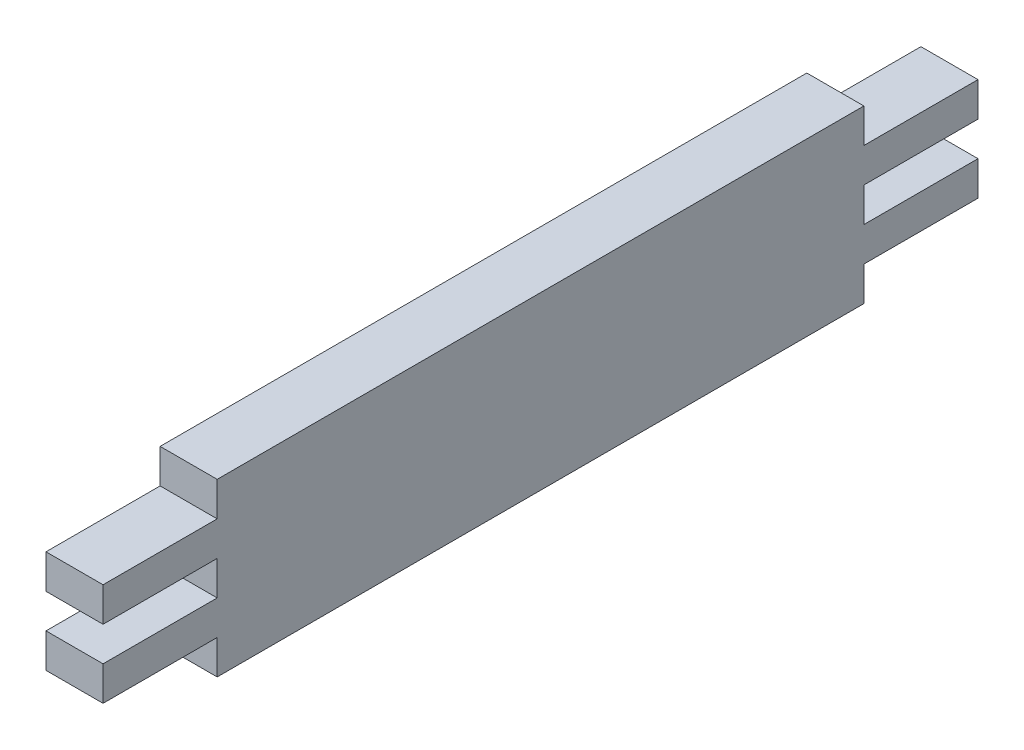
ISO-10303-21;
HEADER;
FILE_DESCRIPTION(('STEP AP214'),'2;1');
FILE_NAME('part.step','',(''),(''),'','','');
FILE_SCHEMA(('AUTOMOTIVE_DESIGN { 1 0 10303 214 1 1 1 1 }'));
ENDSEC;
DATA;
#1=APPLICATION_CONTEXT('core data for automotive mechanical design processes');
#2=APPLICATION_PROTOCOL_DEFINITION('international standard','automotive_design',2000,#1);
#3=PRODUCT_CONTEXT('',#1,'mechanical');
#4=PRODUCT('Part','Part','',(#3));
#5=PRODUCT_RELATED_PRODUCT_CATEGORY('part','',(#4));
#6=PRODUCT_DEFINITION_FORMATION('','',#4);
#7=PRODUCT_DEFINITION_CONTEXT('part definition',#1,'design');
#8=PRODUCT_DEFINITION('design','',#6,#7);
#9=PRODUCT_DEFINITION_SHAPE('','',#8);
#10=(LENGTH_UNIT() NAMED_UNIT(*) SI_UNIT(.MILLI.,.METRE.));
#11=(NAMED_UNIT(*) PLANE_ANGLE_UNIT() SI_UNIT($,.RADIAN.));
#12=(NAMED_UNIT(*) SI_UNIT($,.STERADIAN.) SOLID_ANGLE_UNIT());
#13=UNCERTAINTY_MEASURE_WITH_UNIT(LENGTH_MEASURE(1.E-05),#10,'distance_accuracy_value','');
#14=(GEOMETRIC_REPRESENTATION_CONTEXT(3) GLOBAL_UNCERTAINTY_ASSIGNED_CONTEXT((#13)) GLOBAL_UNIT_ASSIGNED_CONTEXT((#10,
#11,#12)) REPRESENTATION_CONTEXT('',''));
#15=CARTESIAN_POINT('',(0.,0.,0.));
#16=DIRECTION('',(0.,0.,1.));
#17=DIRECTION('',(1.,0.,0.));
#18=AXIS2_PLACEMENT_3D('',#15,#16,#17);
#19=CARTESIAN_POINT('',(3.,-4.5,23.));
#20=DIRECTION('',(0.,0.,-1.));
#21=DIRECTION('',(-1.,0.,0.));
#22=AXIS2_PLACEMENT_3D('',#19,#20,#21);
#23=PLANE('',#22);
#24=DIRECTION('',(0.,-1.,0.));
#25=VECTOR('',#24,1.);
#26=CARTESIAN_POINT('',(0.,-4.5,23.));
#27=LINE('',#26,#25);
#28=CARTESIAN_POINT('',(0.,2.7,23.));
#29=VERTEX_POINT('',#28);
#30=CARTESIAN_POINT('',(0.,0.9,23.));
#31=VERTEX_POINT('',#30);
#32=EDGE_CURVE('E193',#29,#31,#27,.T.);
#33=ORIENTED_EDGE('',*,*,#32,.T.);
#34=DIRECTION('',(-1.,0.,0.));
#35=VECTOR('',#34,1.);
#36=CARTESIAN_POINT('',(10.,0.9,23.));
#37=LINE('',#36,#35);
#38=CARTESIAN_POINT('',(3.,0.9,23.));
#39=VERTEX_POINT('',#38);
#40=EDGE_CURVE('E311',#39,#31,#37,.T.);
#41=ORIENTED_EDGE('',*,*,#40,.F.);
#42=DIRECTION('',(0.,-1.,0.));
#43=VECTOR('',#42,1.);
#44=CARTESIAN_POINT('',(3.,-4.5,23.));
#45=LINE('',#44,#43);
#46=CARTESIAN_POINT('',(3.,2.7,23.));
#47=VERTEX_POINT('',#46);
#48=EDGE_CURVE('E40',#47,#39,#45,.T.);
#49=ORIENTED_EDGE('',*,*,#48,.F.);
#50=DIRECTION('',(-1.,0.,0.));
#51=VECTOR('',#50,1.);
#52=CARTESIAN_POINT('',(10.,2.7,23.));
#53=LINE('',#52,#51);
#54=EDGE_CURVE('E288',#47,#29,#53,.T.);
#55=ORIENTED_EDGE('',*,*,#54,.T.);
#56=EDGE_LOOP('',(#33,#41,#49,#55));
#57=FACE_BOUND('',#56,.T.);
#58=ADVANCED_FACE('F31',(#57),#23,.F.);
#59=CARTESIAN_POINT('',(3.,-4.5,-23.));
#60=DIRECTION('',(0.,0.,1.));
#61=DIRECTION('',(1.,0.,0.));
#62=AXIS2_PLACEMENT_3D('',#59,#60,#61);
#63=PLANE('',#62);
#64=DIRECTION('',(0.,1.,0.));
#65=VECTOR('',#64,1.);
#66=CARTESIAN_POINT('',(3.,-4.5,-23.));
#67=LINE('',#66,#65);
#68=CARTESIAN_POINT('',(3.,0.9,-23.));
#69=VERTEX_POINT('',#68);
#70=CARTESIAN_POINT('',(3.,2.7,-23.));
#71=VERTEX_POINT('',#70);
#72=EDGE_CURVE('E192',#69,#71,#67,.T.);
#73=ORIENTED_EDGE('',*,*,#72,.F.);
#74=DIRECTION('',(-1.,0.,0.));
#75=VECTOR('',#74,1.);
#76=CARTESIAN_POINT('',(10.,0.9,-23.));
#77=LINE('',#76,#75);
#78=CARTESIAN_POINT('',(0.,0.9,-23.));
#79=VERTEX_POINT('',#78);
#80=EDGE_CURVE('E244',#69,#79,#77,.T.);
#81=ORIENTED_EDGE('',*,*,#80,.T.);
#82=DIRECTION('',(0.,1.,0.));
#83=VECTOR('',#82,1.);
#84=CARTESIAN_POINT('',(0.,-4.5,-23.));
#85=LINE('',#84,#83);
#86=CARTESIAN_POINT('',(0.,2.7,-23.));
#87=VERTEX_POINT('',#86);
#88=EDGE_CURVE('E208',#79,#87,#85,.T.);
#89=ORIENTED_EDGE('',*,*,#88,.T.);
#90=DIRECTION('',(-1.,0.,0.));
#91=VECTOR('',#90,1.);
#92=CARTESIAN_POINT('',(10.,2.7,-23.));
#93=LINE('',#92,#91);
#94=EDGE_CURVE('E223',#71,#87,#93,.T.);
#95=ORIENTED_EDGE('',*,*,#94,.F.);
#96=EDGE_LOOP('',(#73,#81,#89,#95));
#97=FACE_BOUND('',#96,.T.);
#98=ADVANCED_FACE('F369',(#97),#63,.F.);
#99=CARTESIAN_POINT('',(3.,-2.7,-23.));
#100=VERTEX_POINT('',#99);
#101=CARTESIAN_POINT('',(3.,-0.9,-23.));
#102=VERTEX_POINT('',#101);
#103=EDGE_CURVE('E194',#100,#102,#67,.T.);
#104=ORIENTED_EDGE('',*,*,#103,.F.);
#105=DIRECTION('',(-1.,0.,0.));
#106=VECTOR('',#105,1.);
#107=CARTESIAN_POINT('',(10.,-2.7,-23.));
#108=LINE('',#107,#106);
#109=CARTESIAN_POINT('',(0.,-2.7,-23.));
#110=VERTEX_POINT('',#109);
#111=EDGE_CURVE('E268',#100,#110,#108,.T.);
#112=ORIENTED_EDGE('',*,*,#111,.T.);
#113=CARTESIAN_POINT('',(0.,-0.900000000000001,-23.));
#114=VERTEX_POINT('',#113);
#115=EDGE_CURVE('E207',#110,#114,#85,.T.);
#116=ORIENTED_EDGE('',*,*,#115,.T.);
#117=DIRECTION('',(-1.,0.,0.));
#118=VECTOR('',#117,1.);
#119=CARTESIAN_POINT('',(10.,-0.9,-23.));
#120=LINE('',#119,#118);
#121=EDGE_CURVE('E245',#102,#114,#120,.T.);
#122=ORIENTED_EDGE('',*,*,#121,.F.);
#123=EDGE_LOOP('',(#104,#112,#116,#122));
#124=FACE_BOUND('',#123,.T.);
#125=ADVANCED_FACE('F33',(#124),#63,.F.);
#126=CARTESIAN_POINT('',(3.,4.5,23.));
#127=DIRECTION('',(0.,-1.,0.));
#128=DIRECTION('',(0.,0.,-1.));
#129=AXIS2_PLACEMENT_3D('',#126,#127,#128);
#130=PLANE('',#129);
#131=DIRECTION('',(0.,0.,1.));
#132=VECTOR('',#131,1.);
#133=CARTESIAN_POINT('',(0.,4.5,23.));
#134=LINE('',#133,#132);
#135=CARTESIAN_POINT('',(0.,4.5,-17.));
#136=VERTEX_POINT('',#135);
#137=CARTESIAN_POINT('',(0.,4.5,17.));
#138=VERTEX_POINT('',#137);
#139=EDGE_CURVE('E203',#136,#138,#134,.T.);
#140=ORIENTED_EDGE('',*,*,#139,.T.);
#141=DIRECTION('',(-1.,0.,0.));
#142=VECTOR('',#141,1.);
#143=CARTESIAN_POINT('',(10.,4.5,17.));
#144=LINE('',#143,#142);
#145=CARTESIAN_POINT('',(3.,4.5,17.));
#146=VERTEX_POINT('',#145);
#147=EDGE_CURVE('E284',#146,#138,#144,.T.);
#148=ORIENTED_EDGE('',*,*,#147,.F.);
#149=DIRECTION('',(0.,0.,1.));
#150=VECTOR('',#149,1.);
#151=CARTESIAN_POINT('',(3.,4.5,23.));
#152=LINE('',#151,#150);
#153=CARTESIAN_POINT('',(3.,4.5,-17.));
#154=VERTEX_POINT('',#153);
#155=EDGE_CURVE('E213',#154,#146,#152,.T.);
#156=ORIENTED_EDGE('',*,*,#155,.F.);
#157=DIRECTION('',(-1.,0.,0.));
#158=VECTOR('',#157,1.);
#159=CARTESIAN_POINT('',(10.,4.5,-17.));
#160=LINE('',#159,#158);
#161=EDGE_CURVE('E222',#154,#136,#160,.T.);
#162=ORIENTED_EDGE('',*,*,#161,.T.);
#163=EDGE_LOOP('',(#140,#148,#156,#162));
#164=FACE_BOUND('',#163,.T.);
#165=ADVANCED_FACE('F354',(#164),#130,.F.);
#166=CARTESIAN_POINT('',(0.,-0.9,23.));
#167=VERTEX_POINT('',#166);
#168=CARTESIAN_POINT('',(0.,-2.7,23.));
#169=VERTEX_POINT('',#168);
#170=EDGE_CURVE('E197',#167,#169,#27,.T.);
#171=ORIENTED_EDGE('',*,*,#170,.T.);
#172=DIRECTION('',(-1.,0.,0.));
#173=VECTOR('',#172,1.);
#174=CARTESIAN_POINT('',(10.,-2.7,23.));
#175=LINE('',#174,#173);
#176=CARTESIAN_POINT('',(3.,-2.7,23.));
#177=VERTEX_POINT('',#176);
#178=EDGE_CURVE('E48',#177,#169,#175,.T.);
#179=ORIENTED_EDGE('',*,*,#178,.F.);
#180=CARTESIAN_POINT('',(3.,-0.9,23.));
#181=VERTEX_POINT('',#180);
#182=EDGE_CURVE('E212',#181,#177,#45,.T.);
#183=ORIENTED_EDGE('',*,*,#182,.F.);
#184=DIRECTION('',(-1.,0.,0.));
#185=VECTOR('',#184,1.);
#186=CARTESIAN_POINT('',(10.,-0.9,23.));
#187=LINE('',#186,#185);
#188=EDGE_CURVE('E307',#181,#167,#187,.T.);
#189=ORIENTED_EDGE('',*,*,#188,.T.);
#190=EDGE_LOOP('',(#171,#179,#183,#189));
#191=FACE_BOUND('',#190,.T.);
#192=ADVANCED_FACE('F330',(#191),#23,.F.);
#193=CARTESIAN_POINT('',(3.,-4.5,23.));
#194=DIRECTION('',(0.,1.,0.));
#195=DIRECTION('',(0.,0.,1.));
#196=AXIS2_PLACEMENT_3D('',#193,#194,#195);
#197=PLANE('',#196);
#198=DIRECTION('',(0.,0.,-1.));
#199=VECTOR('',#198,1.);
#200=CARTESIAN_POINT('',(3.,-4.5,23.));
#201=LINE('',#200,#199);
#202=CARTESIAN_POINT('',(3.,-4.5,17.));
#203=VERTEX_POINT('',#202);
#204=CARTESIAN_POINT('',(3.,-4.5,-17.));
#205=VERTEX_POINT('',#204);
#206=EDGE_CURVE('E11',#203,#205,#201,.T.);
#207=ORIENTED_EDGE('',*,*,#206,.F.);
#208=DIRECTION('',(-1.,0.,0.));
#209=VECTOR('',#208,1.);
#210=CARTESIAN_POINT('',(10.,-4.5,17.));
#211=LINE('',#210,#209);
#212=CARTESIAN_POINT('',(0.,-4.5,17.));
#213=VERTEX_POINT('',#212);
#214=EDGE_CURVE('E173',#203,#213,#211,.T.);
#215=ORIENTED_EDGE('',*,*,#214,.T.);
#216=DIRECTION('',(0.,0.,-1.));
#217=VECTOR('',#216,1.);
#218=CARTESIAN_POINT('',(0.,-4.5,23.));
#219=LINE('',#218,#217);
#220=CARTESIAN_POINT('',(0.,-4.5,-17.));
#221=VERTEX_POINT('',#220);
#222=EDGE_CURVE('E35',#213,#221,#219,.T.);
#223=ORIENTED_EDGE('',*,*,#222,.T.);
#224=DIRECTION('',(-1.,0.,0.));
#225=VECTOR('',#224,1.);
#226=CARTESIAN_POINT('',(10.,-4.5,-17.));
#227=LINE('',#226,#225);
#228=EDGE_CURVE('E269',#205,#221,#227,.T.);
#229=ORIENTED_EDGE('',*,*,#228,.F.);
#230=EDGE_LOOP('',(#207,#215,#223,#229));
#231=FACE_BOUND('',#230,.T.);
#232=ADVANCED_FACE('F183',(#231),#197,.F.);
#233=CARTESIAN_POINT('',(3.,4.5,-23.));
#234=DIRECTION('',(-1.,0.,0.));
#235=DIRECTION('',(0.,0.,1.));
#236=AXIS2_PLACEMENT_3D('',#233,#234,#235);
#237=PLANE('',#236);
#238=DIRECTION('',(0.,0.,-1.));
#239=VECTOR('',#238,1.);
#240=CARTESIAN_POINT('',(3.,-2.7,-23.));
#241=LINE('',#240,#239);
#242=CARTESIAN_POINT('',(3.,-2.7,17.));
#243=VERTEX_POINT('',#242);
#244=EDGE_CURVE('E321',#177,#243,#241,.T.);
#245=ORIENTED_EDGE('',*,*,#244,.T.);
#246=DIRECTION('',(0.,-1.,0.));
#247=VECTOR('',#246,1.);
#248=CARTESIAN_POINT('',(3.,4.5,17.));
#249=LINE('',#248,#247);
#250=EDGE_CURVE('E319',#243,#203,#249,.T.);
#251=ORIENTED_EDGE('',*,*,#250,.T.);
#252=ORIENTED_EDGE('',*,*,#206,.T.);
#253=DIRECTION('',(0.,1.,0.));
#254=VECTOR('',#253,1.);
#255=CARTESIAN_POINT('',(3.,4.5,-17.));
#256=LINE('',#255,#254);
#257=CARTESIAN_POINT('',(3.,-2.7,-17.));
#258=VERTEX_POINT('',#257);
#259=EDGE_CURVE('E265',#205,#258,#256,.T.);
#260=ORIENTED_EDGE('',*,*,#259,.T.);
#261=DIRECTION('',(0.,0.,-1.));
#262=VECTOR('',#261,1.);
#263=CARTESIAN_POINT('',(3.,-2.7,-23.));
#264=LINE('',#263,#262);
#265=EDGE_CURVE('E262',#258,#100,#264,.T.);
#266=ORIENTED_EDGE('',*,*,#265,.T.);
#267=ORIENTED_EDGE('',*,*,#103,.T.);
#268=DIRECTION('',(0.,0.,1.));
#269=VECTOR('',#268,1.);
#270=CARTESIAN_POINT('',(3.,-0.900000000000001,-23.));
#271=LINE('',#270,#269);
#272=CARTESIAN_POINT('',(3.,-0.9,-17.));
#273=VERTEX_POINT('',#272);
#274=EDGE_CURVE('E241',#102,#273,#271,.T.);
#275=ORIENTED_EDGE('',*,*,#274,.T.);
#276=DIRECTION('',(0.,1.,0.));
#277=VECTOR('',#276,1.);
#278=CARTESIAN_POINT('',(3.,4.5,-17.));
#279=LINE('',#278,#277);
#280=CARTESIAN_POINT('',(3.,0.9,-17.));
#281=VERTEX_POINT('',#280);
#282=EDGE_CURVE('E238',#273,#281,#279,.T.);
#283=ORIENTED_EDGE('',*,*,#282,.T.);
#284=DIRECTION('',(0.,0.,-1.));
#285=VECTOR('',#284,1.);
#286=CARTESIAN_POINT('',(3.,0.9,-23.));
#287=LINE('',#286,#285);
#288=EDGE_CURVE('E235',#281,#69,#287,.T.);
#289=ORIENTED_EDGE('',*,*,#288,.T.);
#290=ORIENTED_EDGE('',*,*,#72,.T.);
#291=DIRECTION('',(0.,0.,1.));
#292=VECTOR('',#291,1.);
#293=CARTESIAN_POINT('',(3.,2.7,-23.));
#294=LINE('',#293,#292);
#295=CARTESIAN_POINT('',(3.,2.7,-17.));
#296=VERTEX_POINT('',#295);
#297=EDGE_CURVE('E219',#71,#296,#294,.T.);
#298=ORIENTED_EDGE('',*,*,#297,.T.);
#299=DIRECTION('',(0.,1.,0.));
#300=VECTOR('',#299,1.);
#301=CARTESIAN_POINT('',(3.,4.5,-17.));
#302=LINE('',#301,#300);
#303=EDGE_CURVE('E216',#296,#154,#302,.T.);
#304=ORIENTED_EDGE('',*,*,#303,.T.);
#305=ORIENTED_EDGE('',*,*,#155,.T.);
#306=DIRECTION('',(0.,-1.,0.));
#307=VECTOR('',#306,1.);
#308=CARTESIAN_POINT('',(3.,4.5,17.));
#309=LINE('',#308,#307);
#310=CARTESIAN_POINT('',(3.,2.7,17.));
#311=VERTEX_POINT('',#310);
#312=EDGE_CURVE('E278',#146,#311,#309,.T.);
#313=ORIENTED_EDGE('',*,*,#312,.T.);
#314=DIRECTION('',(0.,0.,1.));
#315=VECTOR('',#314,1.);
#316=CARTESIAN_POINT('',(3.,2.7,-23.));
#317=LINE('',#316,#315);
#318=EDGE_CURVE('E281',#311,#47,#317,.T.);
#319=ORIENTED_EDGE('',*,*,#318,.T.);
#320=ORIENTED_EDGE('',*,*,#48,.T.);
#321=DIRECTION('',(0.,0.,-1.));
#322=VECTOR('',#321,1.);
#323=CARTESIAN_POINT('',(3.,0.9,-23.));
#324=LINE('',#323,#322);
#325=CARTESIAN_POINT('',(3.,0.9,17.));
#326=VERTEX_POINT('',#325);
#327=EDGE_CURVE('E298',#39,#326,#324,.T.);
#328=ORIENTED_EDGE('',*,*,#327,.T.);
#329=DIRECTION('',(0.,-1.,0.));
#330=VECTOR('',#329,1.);
#331=CARTESIAN_POINT('',(3.,4.5,17.));
#332=LINE('',#331,#330);
#333=CARTESIAN_POINT('',(3.,-0.9,17.));
#334=VERTEX_POINT('',#333);
#335=EDGE_CURVE('E295',#326,#334,#332,.T.);
#336=ORIENTED_EDGE('',*,*,#335,.T.);
#337=DIRECTION('',(0.,0.,1.));
#338=VECTOR('',#337,1.);
#339=CARTESIAN_POINT('',(3.,-0.900000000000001,-23.));
#340=LINE('',#339,#338);
#341=EDGE_CURVE('E301',#334,#181,#340,.T.);
#342=ORIENTED_EDGE('',*,*,#341,.T.);
#343=ORIENTED_EDGE('',*,*,#182,.T.);
#344=EDGE_LOOP('',(#245,#251,#252,#260,#266,#267,#275,#283,#289,#290,#298,#304,#305,#313,#319,
#320,#328,#336,#342,#343));
#345=FACE_BOUND('',#344,.T.);
#346=ADVANCED_FACE('F336',(#345),#237,.F.);
#347=CARTESIAN_POINT('',(0.,4.5,-23.));
#348=DIRECTION('',(-1.,0.,0.));
#349=DIRECTION('',(0.,0.,1.));
#350=AXIS2_PLACEMENT_3D('',#347,#348,#349);
#351=PLANE('',#350);
#352=DIRECTION('',(0.,-1.,0.));
#353=VECTOR('',#352,1.);
#354=CARTESIAN_POINT('',(0.,-2.7,17.));
#355=LINE('',#354,#353);
#356=CARTESIAN_POINT('',(0.,-2.7,17.));
#357=VERTEX_POINT('',#356);
#358=EDGE_CURVE('E170',#357,#213,#355,.T.);
#359=ORIENTED_EDGE('',*,*,#358,.F.);
#360=DIRECTION('',(0.,0.,-1.));
#361=VECTOR('',#360,1.);
#362=CARTESIAN_POINT('',(0.,-2.7,17.));
#363=LINE('',#362,#361);
#364=EDGE_CURVE('E179',#169,#357,#363,.T.);
#365=ORIENTED_EDGE('',*,*,#364,.F.);
#366=ORIENTED_EDGE('',*,*,#170,.F.);
#367=DIRECTION('',(0.,0.,1.));
#368=VECTOR('',#367,1.);
#369=CARTESIAN_POINT('',(0.,-0.9,17.));
#370=LINE('',#369,#368);
#371=CARTESIAN_POINT('',(0.,-0.900000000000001,17.));
#372=VERTEX_POINT('',#371);
#373=EDGE_CURVE('E316',#372,#167,#370,.T.);
#374=ORIENTED_EDGE('',*,*,#373,.F.);
#375=DIRECTION('',(0.,-1.,0.));
#376=VECTOR('',#375,1.);
#377=CARTESIAN_POINT('',(0.,0.9,17.));
#378=LINE('',#377,#376);
#379=CARTESIAN_POINT('',(0.,0.9,17.));
#380=VERTEX_POINT('',#379);
#381=EDGE_CURVE('E56',#380,#372,#378,.T.);
#382=ORIENTED_EDGE('',*,*,#381,.F.);
#383=DIRECTION('',(0.,0.,-1.));
#384=VECTOR('',#383,1.);
#385=CARTESIAN_POINT('',(0.,0.9,17.));
#386=LINE('',#385,#384);
#387=EDGE_CURVE('E308',#31,#380,#386,.T.);
#388=ORIENTED_EDGE('',*,*,#387,.F.);
#389=ORIENTED_EDGE('',*,*,#32,.F.);
#390=DIRECTION('',(0.,0.,1.));
#391=VECTOR('',#390,1.);
#392=CARTESIAN_POINT('',(0.,2.7,17.));
#393=LINE('',#392,#391);
#394=CARTESIAN_POINT('',(0.,2.7,17.));
#395=VERTEX_POINT('',#394);
#396=EDGE_CURVE('E289',#395,#29,#393,.T.);
#397=ORIENTED_EDGE('',*,*,#396,.F.);
#398=DIRECTION('',(0.,-1.,0.));
#399=VECTOR('',#398,1.);
#400=CARTESIAN_POINT('',(0.,4.5,17.));
#401=LINE('',#400,#399);
#402=EDGE_CURVE('E293',#138,#395,#401,.T.);
#403=ORIENTED_EDGE('',*,*,#402,.F.);
#404=ORIENTED_EDGE('',*,*,#139,.F.);
#405=DIRECTION('',(0.,1.,0.));
#406=VECTOR('',#405,1.);
#407=CARTESIAN_POINT('',(0.,4.5,-17.));
#408=LINE('',#407,#406);
#409=CARTESIAN_POINT('',(0.,2.7,-17.));
#410=VERTEX_POINT('',#409);
#411=EDGE_CURVE('E227',#410,#136,#408,.T.);
#412=ORIENTED_EDGE('',*,*,#411,.F.);
#413=DIRECTION('',(0.,0.,1.));
#414=VECTOR('',#413,1.);
#415=CARTESIAN_POINT('',(0.,2.7,-23.));
#416=LINE('',#415,#414);
#417=EDGE_CURVE('E232',#87,#410,#416,.T.);
#418=ORIENTED_EDGE('',*,*,#417,.F.);
#419=ORIENTED_EDGE('',*,*,#88,.F.);
#420=DIRECTION('',(0.,0.,-1.));
#421=VECTOR('',#420,1.);
#422=CARTESIAN_POINT('',(0.,0.9,-23.));
#423=LINE('',#422,#421);
#424=CARTESIAN_POINT('',(0.,0.9,-17.));
#425=VERTEX_POINT('',#424);
#426=EDGE_CURVE('E249',#425,#79,#423,.T.);
#427=ORIENTED_EDGE('',*,*,#426,.F.);
#428=DIRECTION('',(0.,1.,0.));
#429=VECTOR('',#428,1.);
#430=CARTESIAN_POINT('',(0.,0.9,-17.));
#431=LINE('',#430,#429);
#432=CARTESIAN_POINT('',(0.,-0.9,-17.));
#433=VERTEX_POINT('',#432);
#434=EDGE_CURVE('E256',#433,#425,#431,.T.);
#435=ORIENTED_EDGE('',*,*,#434,.F.);
#436=DIRECTION('',(0.,0.,1.));
#437=VECTOR('',#436,1.);
#438=CARTESIAN_POINT('',(0.,-0.9,-23.));
#439=LINE('',#438,#437);
#440=EDGE_CURVE('E259',#114,#433,#439,.T.);
#441=ORIENTED_EDGE('',*,*,#440,.F.);
#442=ORIENTED_EDGE('',*,*,#115,.F.);
#443=DIRECTION('',(0.,0.,-1.));
#444=VECTOR('',#443,1.);
#445=CARTESIAN_POINT('',(0.,-2.7,-23.));
#446=LINE('',#445,#444);
#447=CARTESIAN_POINT('',(0.,-2.7,-17.));
#448=VERTEX_POINT('',#447);
#449=EDGE_CURVE('E272',#448,#110,#446,.T.);
#450=ORIENTED_EDGE('',*,*,#449,.F.);
#451=DIRECTION('',(0.,1.,0.));
#452=VECTOR('',#451,1.);
#453=CARTESIAN_POINT('',(0.,-2.7,-17.));
#454=LINE('',#453,#452);
#455=EDGE_CURVE('E191',#221,#448,#454,.T.);
#456=ORIENTED_EDGE('',*,*,#455,.F.);
#457=ORIENTED_EDGE('',*,*,#222,.F.);
#458=EDGE_LOOP('',(#359,#365,#366,#374,#382,#388,#389,#397,#403,#404,#412,#418,#419,#427,#435,
#441,#442,#450,#456,#457));
#459=FACE_BOUND('',#458,.T.);
#460=ADVANCED_FACE('F188',(#459),#351,.T.);
#461=CARTESIAN_POINT('',(10.,4.5,-17.));
#462=DIRECTION('',(0.,0.,1.));
#463=DIRECTION('',(1.,0.,0.));
#464=AXIS2_PLACEMENT_3D('',#461,#462,#463);
#465=PLANE('',#464);
#466=DIRECTION('',(-1.,0.,0.));
#467=VECTOR('',#466,1.);
#468=CARTESIAN_POINT('',(10.,2.7,-17.));
#469=LINE('',#468,#467);
#470=EDGE_CURVE('E226',#296,#410,#469,.T.);
#471=ORIENTED_EDGE('',*,*,#470,.T.);
#472=ORIENTED_EDGE('',*,*,#411,.T.);
#473=ORIENTED_EDGE('',*,*,#161,.F.);
#474=ORIENTED_EDGE('',*,*,#303,.F.);
#475=EDGE_LOOP('',(#471,#472,#473,#474));
#476=FACE_BOUND('',#475,.T.);
#477=ADVANCED_FACE('F358',(#476),#465,.F.);
#478=CARTESIAN_POINT('',(10.,2.7,-23.));
#479=DIRECTION('',(0.,-1.,0.));
#480=DIRECTION('',(0.,0.,-1.));
#481=AXIS2_PLACEMENT_3D('',#478,#479,#480);
#482=PLANE('',#481);
#483=ORIENTED_EDGE('',*,*,#94,.T.);
#484=ORIENTED_EDGE('',*,*,#417,.T.);
#485=ORIENTED_EDGE('',*,*,#470,.F.);
#486=ORIENTED_EDGE('',*,*,#297,.F.);
#487=EDGE_LOOP('',(#483,#484,#485,#486));
#488=FACE_BOUND('',#487,.T.);
#489=ADVANCED_FACE('F360',(#488),#482,.F.);
#490=CARTESIAN_POINT('',(10.,0.9,-23.));
#491=DIRECTION('',(0.,1.,0.));
#492=DIRECTION('',(0.,0.,1.));
#493=AXIS2_PLACEMENT_3D('',#490,#491,#492);
#494=PLANE('',#493);
#495=DIRECTION('',(-1.,0.,0.));
#496=VECTOR('',#495,1.);
#497=CARTESIAN_POINT('',(10.,0.9,-17.));
#498=LINE('',#497,#496);
#499=EDGE_CURVE('E251',#281,#425,#498,.T.);
#500=ORIENTED_EDGE('',*,*,#499,.T.);
#501=ORIENTED_EDGE('',*,*,#426,.T.);
#502=ORIENTED_EDGE('',*,*,#80,.F.);
#503=ORIENTED_EDGE('',*,*,#288,.F.);
#504=EDGE_LOOP('',(#500,#501,#502,#503));
#505=FACE_BOUND('',#504,.T.);
#506=ADVANCED_FACE('F371',(#505),#494,.F.);
#507=CARTESIAN_POINT('',(10.,0.9,-17.));
#508=DIRECTION('',(0.,0.,1.));
#509=DIRECTION('',(1.,0.,0.));
#510=AXIS2_PLACEMENT_3D('',#507,#508,#509);
#511=PLANE('',#510);
#512=DIRECTION('',(-1.,0.,0.));
#513=VECTOR('',#512,1.);
#514=CARTESIAN_POINT('',(10.,-0.9,-17.));
#515=LINE('',#514,#513);
#516=EDGE_CURVE('E248',#273,#433,#515,.T.);
#517=ORIENTED_EDGE('',*,*,#516,.T.);
#518=ORIENTED_EDGE('',*,*,#434,.T.);
#519=ORIENTED_EDGE('',*,*,#499,.F.);
#520=ORIENTED_EDGE('',*,*,#282,.F.);
#521=EDGE_LOOP('',(#517,#518,#519,#520));
#522=FACE_BOUND('',#521,.T.);
#523=ADVANCED_FACE('F376',(#522),#511,.F.);
#524=CARTESIAN_POINT('',(10.,-0.9,-23.));
#525=DIRECTION('',(0.,-1.,0.));
#526=DIRECTION('',(0.,0.,-1.));
#527=AXIS2_PLACEMENT_3D('',#524,#525,#526);
#528=PLANE('',#527);
#529=ORIENTED_EDGE('',*,*,#121,.T.);
#530=ORIENTED_EDGE('',*,*,#440,.T.);
#531=ORIENTED_EDGE('',*,*,#516,.F.);
#532=ORIENTED_EDGE('',*,*,#274,.F.);
#533=EDGE_LOOP('',(#529,#530,#531,#532));
#534=FACE_BOUND('',#533,.T.);
#535=ADVANCED_FACE('F378',(#534),#528,.F.);
#536=CARTESIAN_POINT('',(10.,-2.7,-23.));
#537=DIRECTION('',(0.,1.,0.));
#538=DIRECTION('',(0.,0.,1.));
#539=AXIS2_PLACEMENT_3D('',#536,#537,#538);
#540=PLANE('',#539);
#541=DIRECTION('',(-1.,0.,0.));
#542=VECTOR('',#541,1.);
#543=CARTESIAN_POINT('',(10.,-2.7,-17.));
#544=LINE('',#543,#542);
#545=EDGE_CURVE('E271',#258,#448,#544,.T.);
#546=ORIENTED_EDGE('',*,*,#545,.T.);
#547=ORIENTED_EDGE('',*,*,#449,.T.);
#548=ORIENTED_EDGE('',*,*,#111,.F.);
#549=ORIENTED_EDGE('',*,*,#265,.F.);
#550=EDGE_LOOP('',(#546,#547,#548,#549));
#551=FACE_BOUND('',#550,.T.);
#552=ADVANCED_FACE('F385',(#551),#540,.F.);
#553=CARTESIAN_POINT('',(10.,-2.7,-17.));
#554=DIRECTION('',(0.,0.,1.));
#555=DIRECTION('',(1.,0.,0.));
#556=AXIS2_PLACEMENT_3D('',#553,#554,#555);
#557=PLANE('',#556);
#558=ORIENTED_EDGE('',*,*,#228,.T.);
#559=ORIENTED_EDGE('',*,*,#455,.T.);
#560=ORIENTED_EDGE('',*,*,#545,.F.);
#561=ORIENTED_EDGE('',*,*,#259,.F.);
#562=EDGE_LOOP('',(#558,#559,#560,#561));
#563=FACE_BOUND('',#562,.T.);
#564=ADVANCED_FACE('F389',(#563),#557,.F.);
#565=CARTESIAN_POINT('',(10.,4.5,17.));
#566=DIRECTION('',(0.,0.,-1.));
#567=DIRECTION('',(-1.,0.,0.));
#568=AXIS2_PLACEMENT_3D('',#565,#566,#567);
#569=PLANE('',#568);
#570=ORIENTED_EDGE('',*,*,#147,.T.);
#571=ORIENTED_EDGE('',*,*,#402,.T.);
#572=DIRECTION('',(-1.,0.,0.));
#573=VECTOR('',#572,1.);
#574=CARTESIAN_POINT('',(10.,2.7,17.));
#575=LINE('',#574,#573);
#576=EDGE_CURVE('E285',#311,#395,#575,.T.);
#577=ORIENTED_EDGE('',*,*,#576,.F.);
#578=ORIENTED_EDGE('',*,*,#312,.F.);
#579=EDGE_LOOP('',(#570,#571,#577,#578));
#580=FACE_BOUND('',#579,.T.);
#581=ADVANCED_FACE('F350',(#580),#569,.F.);
#582=CARTESIAN_POINT('',(10.,2.7,17.));
#583=DIRECTION('',(0.,-1.,0.));
#584=DIRECTION('',(0.,0.,-1.));
#585=AXIS2_PLACEMENT_3D('',#582,#583,#584);
#586=PLANE('',#585);
#587=ORIENTED_EDGE('',*,*,#576,.T.);
#588=ORIENTED_EDGE('',*,*,#396,.T.);
#589=ORIENTED_EDGE('',*,*,#54,.F.);
#590=ORIENTED_EDGE('',*,*,#318,.F.);
#591=EDGE_LOOP('',(#587,#588,#589,#590));
#592=FACE_BOUND('',#591,.T.);
#593=ADVANCED_FACE('F346',(#592),#586,.F.);
#594=CARTESIAN_POINT('',(10.,0.9,17.));
#595=DIRECTION('',(0.,0.,-1.));
#596=DIRECTION('',(-1.,0.,0.));
#597=AXIS2_PLACEMENT_3D('',#594,#595,#596);
#598=PLANE('',#597);
#599=DIRECTION('',(-1.,0.,0.));
#600=VECTOR('',#599,1.);
#601=CARTESIAN_POINT('',(10.,0.9,17.));
#602=LINE('',#601,#600);
#603=EDGE_CURVE('E304',#326,#380,#602,.T.);
#604=ORIENTED_EDGE('',*,*,#603,.T.);
#605=ORIENTED_EDGE('',*,*,#381,.T.);
#606=DIRECTION('',(-1.,0.,0.));
#607=VECTOR('',#606,1.);
#608=CARTESIAN_POINT('',(10.,-0.9,17.));
#609=LINE('',#608,#607);
#610=EDGE_CURVE('E305',#334,#372,#609,.T.);
#611=ORIENTED_EDGE('',*,*,#610,.F.);
#612=ORIENTED_EDGE('',*,*,#335,.F.);
#613=EDGE_LOOP('',(#604,#605,#611,#612));
#614=FACE_BOUND('',#613,.T.);
#615=ADVANCED_FACE('F338',(#614),#598,.F.);
#616=CARTESIAN_POINT('',(10.,0.9,17.));
#617=DIRECTION('',(0.,1.,0.));
#618=DIRECTION('',(0.,0.,1.));
#619=AXIS2_PLACEMENT_3D('',#616,#617,#618);
#620=PLANE('',#619);
#621=ORIENTED_EDGE('',*,*,#40,.T.);
#622=ORIENTED_EDGE('',*,*,#387,.T.);
#623=ORIENTED_EDGE('',*,*,#603,.F.);
#624=ORIENTED_EDGE('',*,*,#327,.F.);
#625=EDGE_LOOP('',(#621,#622,#623,#624));
#626=FACE_BOUND('',#625,.T.);
#627=ADVANCED_FACE('F340',(#626),#620,.F.);
#628=CARTESIAN_POINT('',(10.,-0.9,17.));
#629=DIRECTION('',(0.,-1.,0.));
#630=DIRECTION('',(0.,0.,-1.));
#631=AXIS2_PLACEMENT_3D('',#628,#629,#630);
#632=PLANE('',#631);
#633=ORIENTED_EDGE('',*,*,#610,.T.);
#634=ORIENTED_EDGE('',*,*,#373,.T.);
#635=ORIENTED_EDGE('',*,*,#188,.F.);
#636=ORIENTED_EDGE('',*,*,#341,.F.);
#637=EDGE_LOOP('',(#633,#634,#635,#636));
#638=FACE_BOUND('',#637,.T.);
#639=ADVANCED_FACE('F334',(#638),#632,.F.);
#640=CARTESIAN_POINT('',(10.,-2.7,17.));
#641=DIRECTION('',(0.,0.,-1.));
#642=DIRECTION('',(-1.,0.,0.));
#643=AXIS2_PLACEMENT_3D('',#640,#641,#642);
#644=PLANE('',#643);
#645=DIRECTION('',(-1.,0.,0.));
#646=VECTOR('',#645,1.);
#647=CARTESIAN_POINT('',(10.,-2.7,17.));
#648=LINE('',#647,#646);
#649=EDGE_CURVE('E176',#243,#357,#648,.T.);
#650=ORIENTED_EDGE('',*,*,#649,.T.);
#651=ORIENTED_EDGE('',*,*,#358,.T.);
#652=ORIENTED_EDGE('',*,*,#214,.F.);
#653=ORIENTED_EDGE('',*,*,#250,.F.);
#654=EDGE_LOOP('',(#650,#651,#652,#653));
#655=FACE_BOUND('',#654,.T.);
#656=ADVANCED_FACE('F172',(#655),#644,.F.);
#657=CARTESIAN_POINT('',(10.,-2.7,17.));
#658=DIRECTION('',(0.,1.,0.));
#659=DIRECTION('',(0.,0.,1.));
#660=AXIS2_PLACEMENT_3D('',#657,#658,#659);
#661=PLANE('',#660);
#662=ORIENTED_EDGE('',*,*,#178,.T.);
#663=ORIENTED_EDGE('',*,*,#364,.T.);
#664=ORIENTED_EDGE('',*,*,#649,.F.);
#665=ORIENTED_EDGE('',*,*,#244,.F.);
#666=EDGE_LOOP('',(#662,#663,#664,#665));
#667=FACE_BOUND('',#666,.T.);
#668=ADVANCED_FACE('F326',(#667),#661,.F.);
#669=CLOSED_SHELL('',(#58,#98,#125,#165,#192,#232,#346,#460,#477,#489,#506,#523,#535,#552,#564,
#581,#593,#615,#627,#639,#656,#668));
#670=MANIFOLD_SOLID_BREP('B2',#669);
#671=ADVANCED_BREP_SHAPE_REPRESENTATION('',(#18,#670),#14);
#672=SHAPE_DEFINITION_REPRESENTATION(#9,#671);
ENDSEC;
END-ISO-10303-21;
